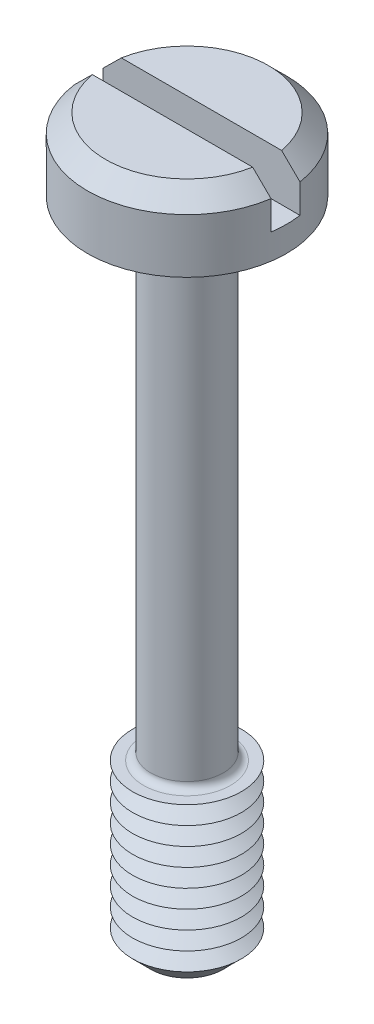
from build123d import *

# Parameters (mm, degrees)
SKETCH1_R           = 2.75
BOSS_EXTRUDE1_DEPTH = 2
SKETCH2_R           = 1
BOSS_EXTRUDE2_DEPTH = 18
SKETCH3_R           = 1.5
BOSS_EXTRUDE3_DEPTH = 4.5
CHAMFER1_SIZE       = 0.5
LPATTERN1_COUNT     = 8
LPATTERN1_PITCH     = 0.5
FILLET1_R           = 0.2
CHAMFER2_SIZE       = 0.5
SKETCH6_W           = 5.5
SKETCH6_H           = 0.8
CUT_EXTRUDE1_DEPTH  = 1.3


with BuildPart() as part:
    # Sketch1 → Boss-Extrude1 (new body)
    with BuildSketch(Plane(origin=(0, 0, 0), x_dir=(1, 0, 0), z_dir=(0, 1, 0))):
        with Locations(Location((0, 0, 0), (0, 0, 270))):
            Circle(SKETCH1_R)
    extrude(amount=BOSS_EXTRUDE1_DEPTH)

    # Sketch2 → Boss-Extrude2 (add)
    with BuildSketch(Plane.XZ):
        with Locations(Location((0, 0, 0), (0, 0, 270))):
            Circle(SKETCH2_R)
    extrude(amount=BOSS_EXTRUDE2_DEPTH)

    # Sketch3 → Boss-Extrude3 (add)
    with BuildSketch(Plane.XZ.offset(18)):
        with Locations(Location((0, 0, 0), (0, 0, 270))):
            Circle(SKETCH3_R)
    extrude(amount=-BOSS_EXTRUDE3_DEPTH)

    # Chamfer1
    chamfer1_edges = [part.edges().sort_by_distance(p)[0] for p in [
        (0, -18, 1.5),
    ]]
    chamfer(chamfer1_edges, length=CHAMFER1_SIZE)

    # Sketch5 → Cut-Revolve1 (revolve, cut)
    with BuildSketch(Plane(origin=(0, 0, 0), x_dir=(0, 0, -1), z_dir=(1, 0, 0))):
        Polygon((-1.5, -13.5), (-1.066987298, -13.75), (-1.5, -14), align=None)
    cut_revolve1 = revolve(axis=Axis((0, -6.58711856, 0), (0, -1, 0)), mode=Mode.SUBTRACT)

    # LPattern1: Cut-Revolve1 ×8
    with Locations(*[(0, -i * LPATTERN1_PITCH, 0) for i in range(1, LPATTERN1_COUNT)]):
        add(cut_revolve1, mode=Mode.SUBTRACT)

    # Fillet1
    fillet1_edges = [part.edges().sort_by_distance(p)[0] for p in [
        (0, 0, 1),
        (0, -13.5, 1),
    ]]
    fillet(fillet1_edges, radius=FILLET1_R)

    # Chamfer2
    chamfer2_edges = [part.edges().sort_by_distance(p)[0] for p in [
        (0, 2, -2.75),
    ]]
    chamfer(chamfer2_edges, length=CHAMFER2_SIZE)

    # Sketch6 → Cut-Extrude1 (cut)
    with BuildSketch(Plane(origin=(0, 2, 0), x_dir=(1, 0, 0), z_dir=(0, 1, 0))):
        Rectangle(SKETCH6_W, SKETCH6_H)
    extrude(amount=-CUT_EXTRUDE1_DEPTH, mode=Mode.SUBTRACT)


solid = part.part
